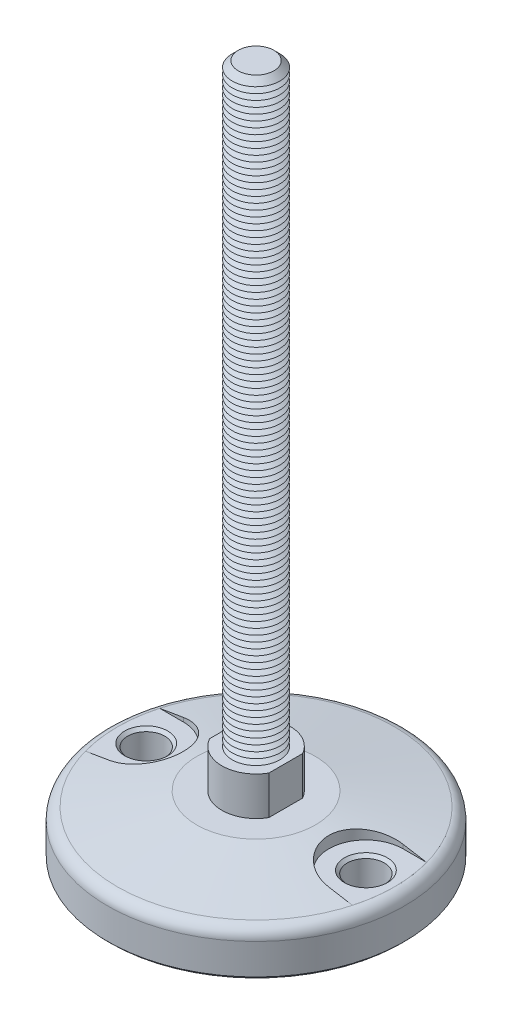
from build123d import *

# Parameters (mm, degrees)
FILLET1_R                = 4
SKETCH3_R                = 11.5
BOSS_EXTRUDE1_DEPTH      = 13
CUT_EXTRUDE1_START       = -13
CUT_EXTRUDE1_DEPTH       = 13
SKETCH5_R                = 8
BOSS_EXTRUDE2_DEPTH      = 200
CHAMFER1_SIZE            = 2
LPATTERN1_COUNT          = 99
LPATTERN1_PITCH          = 2
CUT_EXTRUDE4_DEPTH       = 4.7
SKETCH10_R               = 6.25
CUT_EXTRUDE5_DEPTH       = 15.3
CHAMFER2_SIZE            = 1
CHAMFER2_OF_MIRROR1_SIZE = 1
CHAMFER3_SIZE            = 1


with BuildPart() as part:
    # Sketch2 → Revolve1 (revolve)
    with BuildSketch(Plane(origin=(0, 0, 0), x_dir=(0, 0, -1), z_dir=(1, 0, 0))):
        Polygon((0, 0), (-20, 0), (-50, -5.289809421), (-50, -20), (0, -20), align=None)
    revolve(axis=Axis((0, 61.338865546, 0), (0, -1, 0)))

    # Fillet1
    fillet1_edges = [part.edges().sort_by_distance(p)[0] for p in [
        (0, -5.289809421, -50),
    ]]
    fillet(fillet1_edges, radius=FILLET1_R)

    # Sketch3 → Boss-Extrude1 (add)
    with BuildSketch(Plane(origin=(0, 0, 0), x_dir=(1, 0, 0), z_dir=(0, 1, 0))):
        with Locations(Location((0, 0, 0), (0, 0, 90))):
            Circle(SKETCH3_R)
    extrude(amount=BOSS_EXTRUDE1_DEPTH)

    # Sketch4 → Cut-Extrude1 (cut)
    with BuildSketch(Plane(origin=(0, 13, 0), x_dir=(1, 0, 0), z_dir=(0, 1, 0)).offset(CUT_EXTRUDE1_START)):
        with BuildLine():
            Line((-10, 5.678908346), (-10, -5.678908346))
            ThreePointArc((-10, -5.678908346), (-11.5, 0), (-10, 5.678908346))
        make_face()
        with BuildLine():
            Line((10, -5.678908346), (10, 5.678908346))
            ThreePointArc((10, 5.678908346), (11.5, 0), (10, -5.678908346))
        make_face()
    extrude(amount=CUT_EXTRUDE1_DEPTH, mode=Mode.SUBTRACT)

    # Sketch5 → Boss-Extrude2 (add)
    with BuildSketch(Plane(origin=(0, 13, 0), x_dir=(1, 0, 0), z_dir=(0, 1, 0))):
        with Locations(Location((0, 0, 0), (0, 0, 270))):
            Circle(SKETCH5_R)
    extrude(amount=BOSS_EXTRUDE2_DEPTH)

    # Chamfer1
    chamfer1_edges = [part.edges().sort_by_distance(p)[0] for p in [
        (0, 213, -8),
    ]]
    chamfer(chamfer1_edges, length=CHAMFER1_SIZE)

    # Sketch6 → Cut-Revolve1 (revolve, cut)
    with BuildSketch(Plane(origin=(0, 0, 0), x_dir=(0, 0, -1), z_dir=(1, 0, 0))):
        Polygon((-8, 13), (-6.267949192, 14), (-8, 15), align=None)
    cut_revolve1 = revolve(axis=Axis((0, 61.338865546, 0), (0, -1, 0)), mode=Mode.SUBTRACT)

    # LPattern1: Cut-Revolve1 ×99
    with Locations(*[(0, i * LPATTERN1_PITCH, 0) for i in range(1, LPATTERN1_COUNT)]):
        add(cut_revolve1, mode=Mode.SUBTRACT)

    # Sketch8 → Cut-Extrude4 (cut)
    with BuildSketch(Plane(origin=(0, 0, 0), x_dir=(1, 0, 0), z_dir=(0, 1, 0))):
        with BuildLine():
            Line((-37, 12.5), (-44.990387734, 12.5))
            ThreePointArc((-44.990387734, 12.5), (-46.694592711, 0), (-44.990387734, -12.5))
            Line((-44.990387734, -12.5), (-37, -12.5))
            ThreePointArc((-37, -12.5), (-24.5, 0), (-37, 12.5))
        make_face()
    cut_extrude4 = extrude(amount=-CUT_EXTRUDE4_DEPTH, mode=Mode.SUBTRACT)

    # Sketch10 → Cut-Extrude5 (cut)
    with BuildSketch(Plane(origin=(0, -4.7, 0), x_dir=(1, 0, 0), z_dir=(0, 1, 0))):
        with Locations(Location((-37, 0, 0), (0, 0, 270))):
            Circle(SKETCH10_R)
    cut_extrude5 = extrude(amount=-CUT_EXTRUDE5_DEPTH, mode=Mode.SUBTRACT)

    # Chamfer2
    chamfer2_edges = [part.edges().sort_by_distance(p)[0] for p in [
        (-37, -4.7, -6.25),
        (-37, -20, -6.25),
    ]]
    chamfer(chamfer2_edges, length=CHAMFER2_SIZE)

    # Mirror1: Cut-Extrude4, Cut-Extrude5 across plane
    add(cut_extrude4.mirror(Plane(origin=(0, 0, 0), x_dir=(0, 0, 1), z_dir=(1, 0, 0))), mode=Mode.SUBTRACT)
    add(cut_extrude5.mirror(Plane(origin=(0, 0, 0), x_dir=(0, 0, 1), z_dir=(1, 0, 0))), mode=Mode.SUBTRACT)

    # Chamfer2 of Mirror1
    chamfer2_of_mirror1_edges = [part.edges().sort_by_distance(p)[0] for p in [
        (37, -4.7, -6.25),
        (37, -20, -6.25),
    ]]
    chamfer(chamfer2_of_mirror1_edges, length=CHAMFER2_OF_MIRROR1_SIZE)

    # Chamfer3
    chamfer3_edges = [part.edges().sort_by_distance(p)[0] for p in [
        (0, -20, -50),
    ]]
    chamfer(chamfer3_edges, length=CHAMFER3_SIZE)


solid = part.part
